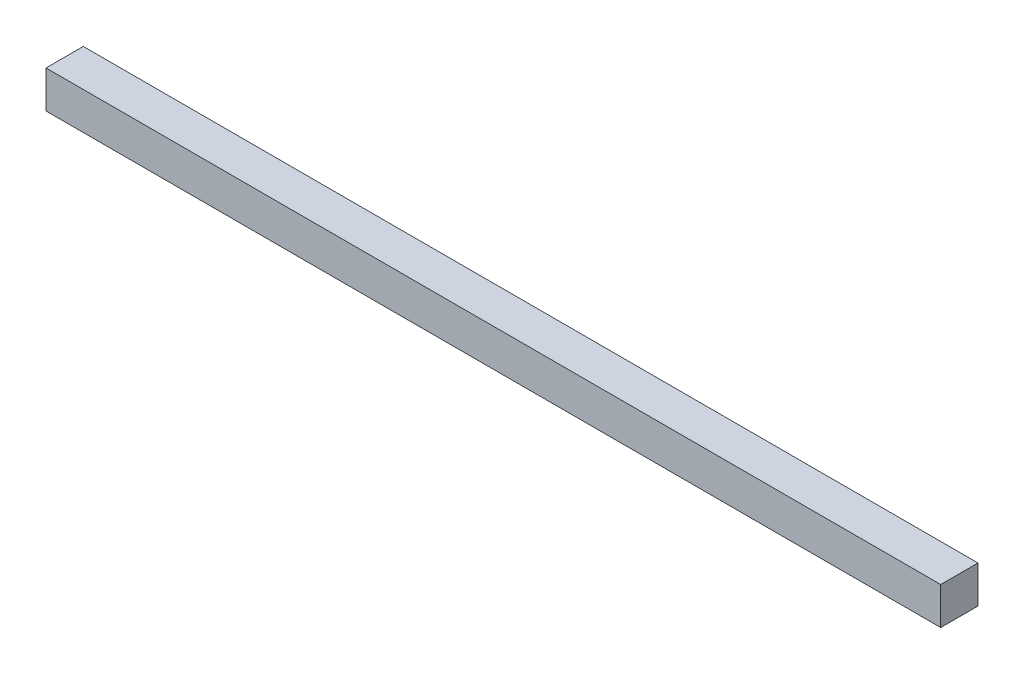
ISO-10303-21;
HEADER;
FILE_DESCRIPTION(('STEP AP214'),'2;1');
FILE_NAME('part.step','',(''),(''),'','','');
FILE_SCHEMA(('AUTOMOTIVE_DESIGN { 1 0 10303 214 1 1 1 1 }'));
ENDSEC;
DATA;
#1=APPLICATION_CONTEXT('core data for automotive mechanical design processes');
#2=APPLICATION_PROTOCOL_DEFINITION('international standard','automotive_design',2000,#1);
#3=PRODUCT_CONTEXT('',#1,'mechanical');
#4=PRODUCT('Part','Part','',(#3));
#5=PRODUCT_RELATED_PRODUCT_CATEGORY('part','',(#4));
#6=PRODUCT_DEFINITION_FORMATION('','',#4);
#7=PRODUCT_DEFINITION_CONTEXT('part definition',#1,'design');
#8=PRODUCT_DEFINITION('design','',#6,#7);
#9=PRODUCT_DEFINITION_SHAPE('','',#8);
#10=(LENGTH_UNIT() NAMED_UNIT(*) SI_UNIT(.MILLI.,.METRE.));
#11=(NAMED_UNIT(*) PLANE_ANGLE_UNIT() SI_UNIT($,.RADIAN.));
#12=(NAMED_UNIT(*) SI_UNIT($,.STERADIAN.) SOLID_ANGLE_UNIT());
#13=UNCERTAINTY_MEASURE_WITH_UNIT(LENGTH_MEASURE(1.E-05),#10,'distance_accuracy_value','');
#14=(GEOMETRIC_REPRESENTATION_CONTEXT(3) GLOBAL_UNCERTAINTY_ASSIGNED_CONTEXT((#13)) GLOBAL_UNIT_ASSIGNED_CONTEXT((#10,
#11,#12)) REPRESENTATION_CONTEXT('',''));
#15=CARTESIAN_POINT('',(0.,0.,0.));
#16=DIRECTION('',(0.,0.,1.));
#17=DIRECTION('',(1.,0.,0.));
#18=AXIS2_PLACEMENT_3D('',#15,#16,#17);
#19=CARTESIAN_POINT('',(76.2,0.,0.));
#20=DIRECTION('',(0.,0.,1.));
#21=DIRECTION('',(1.,0.,0.));
#22=AXIS2_PLACEMENT_3D('',#19,#20,#21);
#23=PLANE('',#22);
#24=DIRECTION('',(0.,1.,0.));
#25=VECTOR('',#24,1.);
#26=CARTESIAN_POINT('',(0.,0.,0.));
#27=LINE('',#26,#25);
#28=CARTESIAN_POINT('',(0.,0.,0.));
#29=VERTEX_POINT('',#28);
#30=CARTESIAN_POINT('',(0.,3.175,0.));
#31=VERTEX_POINT('',#30);
#32=EDGE_CURVE('E96',#29,#31,#27,.T.);
#33=ORIENTED_EDGE('',*,*,#32,.T.);
#34=DIRECTION('',(-1.,0.,0.));
#35=VECTOR('',#34,1.);
#36=CARTESIAN_POINT('',(76.2,3.175,0.));
#37=LINE('',#36,#35);
#38=CARTESIAN_POINT('',(76.2,3.175,0.));
#39=VERTEX_POINT('',#38);
#40=EDGE_CURVE('E11',#39,#31,#37,.T.);
#41=ORIENTED_EDGE('',*,*,#40,.F.);
#42=DIRECTION('',(0.,1.,0.));
#43=VECTOR('',#42,1.);
#44=CARTESIAN_POINT('',(76.2,0.,0.));
#45=LINE('',#44,#43);
#46=CARTESIAN_POINT('',(76.2,0.,0.));
#47=VERTEX_POINT('',#46);
#48=EDGE_CURVE('E84',#47,#39,#45,.T.);
#49=ORIENTED_EDGE('',*,*,#48,.F.);
#50=DIRECTION('',(-1.,0.,0.));
#51=VECTOR('',#50,1.);
#52=CARTESIAN_POINT('',(76.2,0.,0.));
#53=LINE('',#52,#51);
#54=EDGE_CURVE('E92',#47,#29,#53,.T.);
#55=ORIENTED_EDGE('',*,*,#54,.T.);
#56=EDGE_LOOP('',(#33,#41,#49,#55));
#57=FACE_BOUND('',#56,.T.);
#58=ADVANCED_FACE('F33',(#57),#23,.F.);
#59=CARTESIAN_POINT('',(76.2,3.175,0.));
#60=DIRECTION('',(0.,-1.,0.));
#61=DIRECTION('',(0.,0.,-1.));
#62=AXIS2_PLACEMENT_3D('',#59,#60,#61);
#63=PLANE('',#62);
#64=DIRECTION('',(0.,0.,1.));
#65=VECTOR('',#64,1.);
#66=CARTESIAN_POINT('',(0.,3.175,0.));
#67=LINE('',#66,#65);
#68=CARTESIAN_POINT('',(0.,3.175,3.175));
#69=VERTEX_POINT('',#68);
#70=EDGE_CURVE('E88',#31,#69,#67,.T.);
#71=ORIENTED_EDGE('',*,*,#70,.T.);
#72=DIRECTION('',(-1.,0.,0.));
#73=VECTOR('',#72,1.);
#74=CARTESIAN_POINT('',(76.2,3.175,3.175));
#75=LINE('',#74,#73);
#76=CARTESIAN_POINT('',(76.2,3.175,3.175));
#77=VERTEX_POINT('',#76);
#78=EDGE_CURVE('E41',#77,#69,#75,.T.);
#79=ORIENTED_EDGE('',*,*,#78,.F.);
#80=DIRECTION('',(0.,0.,1.));
#81=VECTOR('',#80,1.);
#82=CARTESIAN_POINT('',(76.2,3.175,0.));
#83=LINE('',#82,#81);
#84=EDGE_CURVE('E79',#39,#77,#83,.T.);
#85=ORIENTED_EDGE('',*,*,#84,.F.);
#86=ORIENTED_EDGE('',*,*,#40,.T.);
#87=EDGE_LOOP('',(#71,#79,#85,#86));
#88=FACE_BOUND('',#87,.T.);
#89=ADVANCED_FACE('F87',(#88),#63,.F.);
#90=CARTESIAN_POINT('',(76.2,0.,3.175));
#91=DIRECTION('',(0.,0.,-1.));
#92=DIRECTION('',(-1.,0.,0.));
#93=AXIS2_PLACEMENT_3D('',#90,#91,#92);
#94=PLANE('',#93);
#95=DIRECTION('',(0.,-1.,0.));
#96=VECTOR('',#95,1.);
#97=CARTESIAN_POINT('',(0.,0.,3.175));
#98=LINE('',#97,#96);
#99=CARTESIAN_POINT('',(0.,0.,3.175));
#100=VERTEX_POINT('',#99);
#101=EDGE_CURVE('E66',#69,#100,#98,.T.);
#102=ORIENTED_EDGE('',*,*,#101,.T.);
#103=DIRECTION('',(-1.,0.,0.));
#104=VECTOR('',#103,1.);
#105=CARTESIAN_POINT('',(76.2,0.,3.175));
#106=LINE('',#105,#104);
#107=CARTESIAN_POINT('',(76.2,0.,3.175));
#108=VERTEX_POINT('',#107);
#109=EDGE_CURVE('E89',#108,#100,#106,.T.);
#110=ORIENTED_EDGE('',*,*,#109,.F.);
#111=DIRECTION('',(0.,-1.,0.));
#112=VECTOR('',#111,1.);
#113=CARTESIAN_POINT('',(76.2,0.,3.175));
#114=LINE('',#113,#112);
#115=EDGE_CURVE('E82',#77,#108,#114,.T.);
#116=ORIENTED_EDGE('',*,*,#115,.F.);
#117=ORIENTED_EDGE('',*,*,#78,.T.);
#118=EDGE_LOOP('',(#102,#110,#116,#117));
#119=FACE_BOUND('',#118,.T.);
#120=ADVANCED_FACE('F90',(#119),#94,.F.);
#121=CARTESIAN_POINT('',(76.2,0.,0.));
#122=DIRECTION('',(0.,1.,0.));
#123=DIRECTION('',(0.,0.,1.));
#124=AXIS2_PLACEMENT_3D('',#121,#122,#123);
#125=PLANE('',#124);
#126=DIRECTION('',(0.,0.,-1.));
#127=VECTOR('',#126,1.);
#128=CARTESIAN_POINT('',(0.,0.,0.));
#129=LINE('',#128,#127);
#130=EDGE_CURVE('E72',#100,#29,#129,.T.);
#131=ORIENTED_EDGE('',*,*,#130,.T.);
#132=ORIENTED_EDGE('',*,*,#54,.F.);
#133=DIRECTION('',(0.,0.,-1.));
#134=VECTOR('',#133,1.);
#135=CARTESIAN_POINT('',(76.2,0.,0.));
#136=LINE('',#135,#134);
#137=EDGE_CURVE('E49',#108,#47,#136,.T.);
#138=ORIENTED_EDGE('',*,*,#137,.F.);
#139=ORIENTED_EDGE('',*,*,#109,.T.);
#140=EDGE_LOOP('',(#131,#132,#138,#139));
#141=FACE_BOUND('',#140,.T.);
#142=ADVANCED_FACE('F103',(#141),#125,.F.);
#143=CARTESIAN_POINT('',(76.2,3.175,0.));
#144=DIRECTION('',(1.,0.,0.));
#145=DIRECTION('',(0.,0.,-1.));
#146=AXIS2_PLACEMENT_3D('',#143,#144,#145);
#147=PLANE('',#146);
#148=ORIENTED_EDGE('',*,*,#48,.T.);
#149=ORIENTED_EDGE('',*,*,#84,.T.);
#150=ORIENTED_EDGE('',*,*,#115,.T.);
#151=ORIENTED_EDGE('',*,*,#137,.T.);
#152=EDGE_LOOP('',(#148,#149,#150,#151));
#153=FACE_BOUND('',#152,.T.);
#154=ADVANCED_FACE('F80',(#153),#147,.T.);
#155=CARTESIAN_POINT('',(0.,3.175,0.));
#156=DIRECTION('',(1.,0.,0.));
#157=DIRECTION('',(0.,0.,-1.));
#158=AXIS2_PLACEMENT_3D('',#155,#156,#157);
#159=PLANE('',#158);
#160=ORIENTED_EDGE('',*,*,#32,.F.);
#161=ORIENTED_EDGE('',*,*,#130,.F.);
#162=ORIENTED_EDGE('',*,*,#101,.F.);
#163=ORIENTED_EDGE('',*,*,#70,.F.);
#164=EDGE_LOOP('',(#160,#161,#162,#163));
#165=FACE_BOUND('',#164,.T.);
#166=ADVANCED_FACE('F106',(#165),#159,.F.);
#167=CLOSED_SHELL('',(#58,#89,#120,#142,#154,#166));
#168=MANIFOLD_SOLID_BREP('B2',#167);
#169=ADVANCED_BREP_SHAPE_REPRESENTATION('',(#18,#168),#14);
#170=SHAPE_DEFINITION_REPRESENTATION(#9,#169);
ENDSEC;
END-ISO-10303-21;
